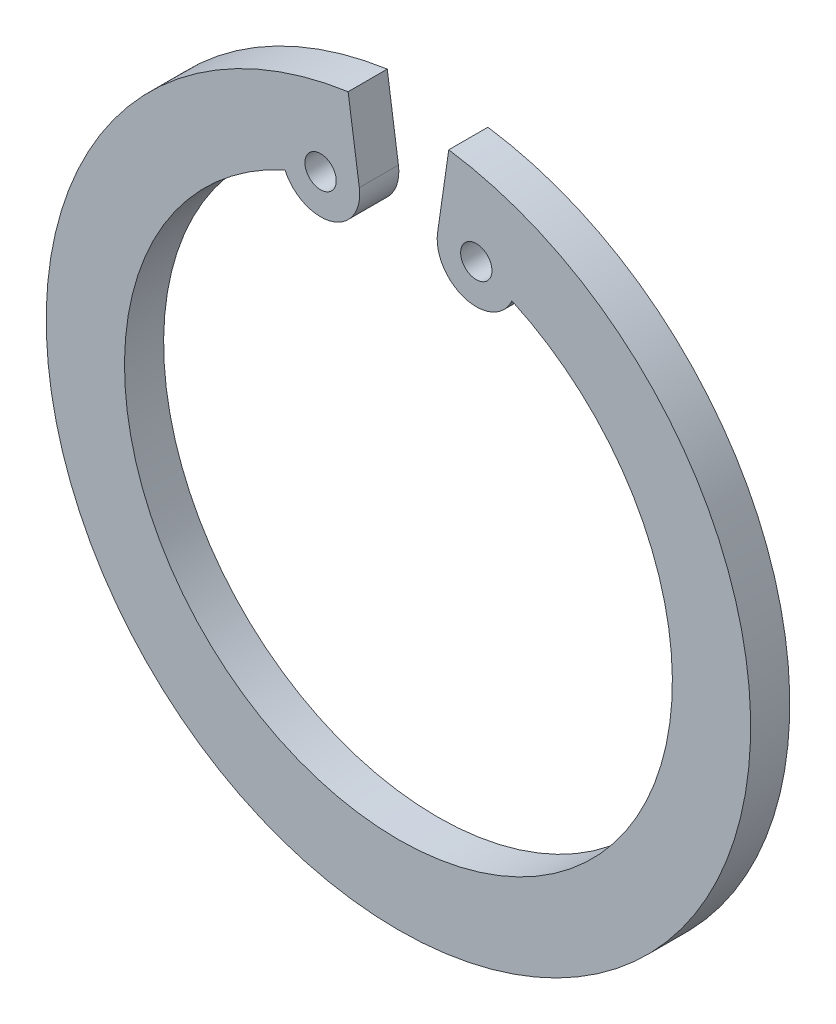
ISO-10303-21;
HEADER;
FILE_DESCRIPTION(('STEP AP214'),'2;1');
FILE_NAME('part.step','',(''),(''),'','','');
FILE_SCHEMA(('AUTOMOTIVE_DESIGN { 1 0 10303 214 1 1 1 1 }'));
ENDSEC;
DATA;
#1=APPLICATION_CONTEXT('core data for automotive mechanical design processes');
#2=APPLICATION_PROTOCOL_DEFINITION('international standard','automotive_design',2000,#1);
#3=PRODUCT_CONTEXT('',#1,'mechanical');
#4=PRODUCT('Part','Part','',(#3));
#5=PRODUCT_RELATED_PRODUCT_CATEGORY('part','',(#4));
#6=PRODUCT_DEFINITION_FORMATION('','',#4);
#7=PRODUCT_DEFINITION_CONTEXT('part definition',#1,'design');
#8=PRODUCT_DEFINITION('design','',#6,#7);
#9=PRODUCT_DEFINITION_SHAPE('','',#8);
#10=(LENGTH_UNIT() NAMED_UNIT(*) SI_UNIT(.MILLI.,.METRE.));
#11=(NAMED_UNIT(*) PLANE_ANGLE_UNIT() SI_UNIT($,.RADIAN.));
#12=(NAMED_UNIT(*) SI_UNIT($,.STERADIAN.) SOLID_ANGLE_UNIT());
#13=UNCERTAINTY_MEASURE_WITH_UNIT(LENGTH_MEASURE(1.E-05),#10,'distance_accuracy_value','');
#14=(GEOMETRIC_REPRESENTATION_CONTEXT(3) GLOBAL_UNCERTAINTY_ASSIGNED_CONTEXT((#13)) GLOBAL_UNIT_ASSIGNED_CONTEXT((#10,
#11,#12)) REPRESENTATION_CONTEXT('',''));
#15=CARTESIAN_POINT('',(0.,0.,0.));
#16=DIRECTION('',(0.,0.,1.));
#17=DIRECTION('',(1.,0.,0.));
#18=AXIS2_PLACEMENT_3D('',#15,#16,#17);
#19=CARTESIAN_POINT('',(0.,-0.211976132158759,-0.396875));
#20=DIRECTION('',(0.,0.,1.));
#21=DIRECTION('',(1.,0.,0.));
#22=AXIS2_PLACEMENT_3D('',#19,#20,#21);
#23=PLANE('',#22);
#24=CARTESIAN_POINT('',(1.57935875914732,5.17389232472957,-0.396875));
#25=DIRECTION('',(0.,0.,1.));
#26=DIRECTION('',(1.,0.,0.));
#27=AXIS2_PLACEMENT_3D('',#24,#25,#26);
#28=CIRCLE('',#27,0.79375);
#29=CARTESIAN_POINT('',(0.793750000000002,5.28728518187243,-0.396875));
#30=VERTEX_POINT('',#29);
#31=CARTESIAN_POINT('',(2.30179316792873,4.84506472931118,-0.396875));
#32=VERTEX_POINT('',#31);
#33=EDGE_CURVE('E110',#30,#32,#28,.T.);
#34=ORIENTED_EDGE('',*,*,#33,.F.);
#35=DIRECTION('',(0.142857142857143,0.989743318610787,0.));
#36=VECTOR('',#35,1.);
#37=CARTESIAN_POINT('',(0.79375,5.28728518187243,-0.396875));
#38=LINE('',#37,#36);
#39=CARTESIAN_POINT('',(1.02053571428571,6.85850270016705,-0.396875));
#40=VERTEX_POINT('',#39);
#41=EDGE_CURVE('E114',#30,#40,#38,.T.);
#42=ORIENTED_EDGE('',*,*,#41,.T.);
#43=CARTESIAN_POINT('',(0.,-0.211976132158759,-0.396875));
#44=DIRECTION('',(0.,0.,-1.));
#45=DIRECTION('',(-1.,0.,0.));
#46=AXIS2_PLACEMENT_3D('',#43,#44,#45);
#47=CIRCLE('',#46,7.14375);
#48=CARTESIAN_POINT('',(-1.02053571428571,6.85850270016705,-0.396875));
#49=VERTEX_POINT('',#48);
#50=EDGE_CURVE('E99',#49,#40,#47,.F.);
#51=ORIENTED_EDGE('',*,*,#50,.F.);
#52=DIRECTION('',(0.142857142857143,-0.989743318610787,0.));
#53=VECTOR('',#52,1.);
#54=CARTESIAN_POINT('',(-1.02053571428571,6.85850270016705,-0.396875));
#55=LINE('',#54,#53);
#56=CARTESIAN_POINT('',(-0.79375,5.28728518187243,-0.396875));
#57=VERTEX_POINT('',#56);
#58=EDGE_CURVE('E95',#49,#57,#55,.T.);
#59=ORIENTED_EDGE('',*,*,#58,.T.);
#60=CARTESIAN_POINT('',(-1.57935875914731,5.17389232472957,-0.396875));
#61=DIRECTION('',(0.,0.,1.));
#62=DIRECTION('',(1.,0.,0.));
#63=AXIS2_PLACEMENT_3D('',#60,#61,#62);
#64=CIRCLE('',#63,0.79375);
#65=CARTESIAN_POINT('',(-2.30179316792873,4.84506472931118,-0.396875));
#66=VERTEX_POINT('',#65);
#67=EDGE_CURVE('E83',#66,#57,#64,.T.);
#68=ORIENTED_EDGE('',*,*,#67,.F.);
#69=CARTESIAN_POINT('',(0.,-0.211976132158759,-0.396875));
#70=DIRECTION('',(0.,0.,-1.));
#71=DIRECTION('',(-1.,0.,0.));
#72=AXIS2_PLACEMENT_3D('',#69,#70,#71);
#73=CIRCLE('',#72,5.55625);
#74=EDGE_CURVE('E93',#66,#32,#73,.F.);
#75=ORIENTED_EDGE('',*,*,#74,.T.);
#76=EDGE_LOOP('',(#34,#42,#51,#59,#68,#75));
#77=FACE_BOUND('',#76,.T.);
#78=CARTESIAN_POINT('',(-1.57935875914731,5.17389232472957,-0.396875));
#79=DIRECTION('',(0.,0.,1.));
#80=DIRECTION('',(1.,0.,0.));
#81=AXIS2_PLACEMENT_3D('',#78,#79,#80);
#82=CIRCLE('',#81,0.3175);
#83=CARTESIAN_POINT('',(-1.26185875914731,5.17389232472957,-0.396875));
#84=VERTEX_POINT('',#83);
#85=EDGE_CURVE('E115',#84,#84,#82,.T.);
#86=ORIENTED_EDGE('',*,*,#85,.T.);
#87=EDGE_LOOP('',(#86));
#88=FACE_BOUND('',#87,.T.);
#89=CARTESIAN_POINT('',(1.57935875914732,5.17389232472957,-0.396875));
#90=DIRECTION('',(0.,0.,1.));
#91=DIRECTION('',(1.,0.,0.));
#92=AXIS2_PLACEMENT_3D('',#89,#90,#91);
#93=CIRCLE('',#92,0.3175);
#94=CARTESIAN_POINT('',(1.89685875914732,5.17389232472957,-0.396875));
#95=VERTEX_POINT('',#94);
#96=EDGE_CURVE('E35',#95,#95,#93,.T.);
#97=ORIENTED_EDGE('',*,*,#96,.T.);
#98=EDGE_LOOP('',(#97));
#99=FACE_BOUND('',#98,.T.);
#100=ADVANCED_FACE('F32',(#77,#88,#99),#23,.F.);
#101=CARTESIAN_POINT('',(1.57935875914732,5.17389232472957,-0.396875));
#102=DIRECTION('',(0.,0.,1.));
#103=DIRECTION('',(1.,0.,0.));
#104=AXIS2_PLACEMENT_3D('',#101,#102,#103);
#105=CYLINDRICAL_SURFACE('',#104,0.3175);
#106=CARTESIAN_POINT('',(1.57935875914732,5.17389232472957,0.396875));
#107=DIRECTION('',(0.,0.,1.));
#108=DIRECTION('',(1.,0.,0.));
#109=AXIS2_PLACEMENT_3D('',#106,#107,#108);
#110=CIRCLE('',#109,0.3175);
#111=CARTESIAN_POINT('',(1.89685875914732,5.17389232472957,0.396875));
#112=VERTEX_POINT('',#111);
#113=EDGE_CURVE('E128',#112,#112,#110,.F.);
#114=ORIENTED_EDGE('',*,*,#113,.F.);
#115=EDGE_LOOP('',(#114));
#116=FACE_BOUND('',#115,.T.);
#117=ORIENTED_EDGE('',*,*,#96,.F.);
#118=EDGE_LOOP('',(#117));
#119=FACE_BOUND('',#118,.T.);
#120=ADVANCED_FACE('F141',(#116,#119),#105,.F.);
#121=CARTESIAN_POINT('',(-1.57935875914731,5.17389232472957,-0.396875));
#122=DIRECTION('',(0.,0.,1.));
#123=DIRECTION('',(1.,0.,0.));
#124=AXIS2_PLACEMENT_3D('',#121,#122,#123);
#125=CYLINDRICAL_SURFACE('',#124,0.3175);
#126=CARTESIAN_POINT('',(-1.57935875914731,5.17389232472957,0.396875));
#127=DIRECTION('',(0.,0.,1.));
#128=DIRECTION('',(1.,0.,0.));
#129=AXIS2_PLACEMENT_3D('',#126,#127,#128);
#130=CIRCLE('',#129,0.3175);
#131=CARTESIAN_POINT('',(-1.26185875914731,5.17389232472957,0.396875));
#132=VERTEX_POINT('',#131);
#133=EDGE_CURVE('E125',#132,#132,#130,.F.);
#134=ORIENTED_EDGE('',*,*,#133,.F.);
#135=EDGE_LOOP('',(#134));
#136=FACE_BOUND('',#135,.T.);
#137=ORIENTED_EDGE('',*,*,#85,.F.);
#138=EDGE_LOOP('',(#137));
#139=FACE_BOUND('',#138,.T.);
#140=ADVANCED_FACE('F143',(#136,#139),#125,.F.);
#141=CARTESIAN_POINT('',(0.79375,5.28728518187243,0.396875));
#142=DIRECTION('',(0.989743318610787,-0.142857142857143,0.));
#143=DIRECTION('',(0.142857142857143,0.989743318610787,0.));
#144=AXIS2_PLACEMENT_3D('',#141,#142,#143);
#145=PLANE('',#144);
#146=DIRECTION('',(0.,0.,1.));
#147=VECTOR('',#146,1.);
#148=CARTESIAN_POINT('',(0.793750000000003,5.28728518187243,-0.396875));
#149=LINE('',#148,#147);
#150=CARTESIAN_POINT('',(0.793750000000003,5.28728518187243,0.396875));
#151=VERTEX_POINT('',#150);
#152=EDGE_CURVE('E111',#151,#30,#149,.F.);
#153=ORIENTED_EDGE('',*,*,#152,.F.);
#154=DIRECTION('',(-0.142857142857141,-0.989743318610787,0.));
#155=VECTOR('',#154,1.);
#156=CARTESIAN_POINT('',(1.02053571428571,6.85850270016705,0.396875));
#157=LINE('',#156,#155);
#158=CARTESIAN_POINT('',(1.02053571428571,6.85850270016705,0.396875));
#159=VERTEX_POINT('',#158);
#160=EDGE_CURVE('E124',#159,#151,#157,.T.);
#161=ORIENTED_EDGE('',*,*,#160,.F.);
#162=DIRECTION('',(0.,0.,-1.));
#163=VECTOR('',#162,1.);
#164=CARTESIAN_POINT('',(1.02053571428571,6.85850270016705,0.396875));
#165=LINE('',#164,#163);
#166=EDGE_CURVE('E131',#40,#159,#165,.F.);
#167=ORIENTED_EDGE('',*,*,#166,.F.);
#168=ORIENTED_EDGE('',*,*,#41,.F.);
#169=EDGE_LOOP('',(#153,#161,#167,#168));
#170=FACE_BOUND('',#169,.T.);
#171=ADVANCED_FACE('F149',(#170),#145,.F.);
#172=CARTESIAN_POINT('',(1.57935875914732,5.17389232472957,-0.396875));
#173=DIRECTION('',(0.,0.,1.));
#174=DIRECTION('',(1.,0.,0.));
#175=AXIS2_PLACEMENT_3D('',#172,#173,#174);
#176=CYLINDRICAL_SURFACE('',#175,0.79375);
#177=ORIENTED_EDGE('',*,*,#152,.T.);
#178=ORIENTED_EDGE('',*,*,#33,.T.);
#179=DIRECTION('',(0.,0.,-1.));
#180=VECTOR('',#179,1.);
#181=CARTESIAN_POINT('',(2.30179316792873,4.84506472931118,0.396875));
#182=LINE('',#181,#180);
#183=CARTESIAN_POINT('',(2.30179316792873,4.84506472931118,0.396875));
#184=VERTEX_POINT('',#183);
#185=EDGE_CURVE('E108',#32,#184,#182,.F.);
#186=ORIENTED_EDGE('',*,*,#185,.T.);
#187=CARTESIAN_POINT('',(1.57935875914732,5.17389232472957,0.396875));
#188=DIRECTION('',(0.,0.,1.));
#189=DIRECTION('',(1.,0.,0.));
#190=AXIS2_PLACEMENT_3D('',#187,#188,#189);
#191=CIRCLE('',#190,0.79375);
#192=EDGE_CURVE('E121',#151,#184,#191,.T.);
#193=ORIENTED_EDGE('',*,*,#192,.F.);
#194=EDGE_LOOP('',(#177,#178,#186,#193));
#195=FACE_BOUND('',#194,.T.);
#196=ADVANCED_FACE('F172',(#195),#176,.T.);
#197=CARTESIAN_POINT('',(0.,-0.211976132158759,0.396875));
#198=DIRECTION('',(0.,0.,-1.));
#199=DIRECTION('',(-1.,0.,0.));
#200=AXIS2_PLACEMENT_3D('',#197,#198,#199);
#201=CYLINDRICAL_SURFACE('',#200,5.55625);
#202=DIRECTION('',(0.,0.,1.));
#203=VECTOR('',#202,1.);
#204=CARTESIAN_POINT('',(-2.30179316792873,4.84506472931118,-0.396875));
#205=LINE('',#204,#203);
#206=CARTESIAN_POINT('',(-2.30179316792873,4.84506472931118,0.396875));
#207=VERTEX_POINT('',#206);
#208=EDGE_CURVE('E90',#207,#66,#205,.F.);
#209=ORIENTED_EDGE('',*,*,#208,.F.);
#210=CARTESIAN_POINT('',(0.,-0.211976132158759,0.396875));
#211=DIRECTION('',(0.,0.,-1.));
#212=DIRECTION('',(-1.,0.,0.));
#213=AXIS2_PLACEMENT_3D('',#210,#211,#212);
#214=CIRCLE('',#213,5.55625);
#215=EDGE_CURVE('E119',#184,#207,#214,.T.);
#216=ORIENTED_EDGE('',*,*,#215,.F.);
#217=ORIENTED_EDGE('',*,*,#185,.F.);
#218=ORIENTED_EDGE('',*,*,#74,.F.);
#219=EDGE_LOOP('',(#209,#216,#217,#218));
#220=FACE_BOUND('',#219,.T.);
#221=ADVANCED_FACE('F169',(#220),#201,.F.);
#222=CARTESIAN_POINT('',(-1.57935875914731,5.17389232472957,-0.396875));
#223=DIRECTION('',(0.,0.,1.));
#224=DIRECTION('',(1.,0.,0.));
#225=AXIS2_PLACEMENT_3D('',#222,#223,#224);
#226=CYLINDRICAL_SURFACE('',#225,0.79375);
#227=CARTESIAN_POINT('',(-1.57935875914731,5.17389232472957,0.396875));
#228=DIRECTION('',(0.,0.,1.));
#229=DIRECTION('',(1.,0.,0.));
#230=AXIS2_PLACEMENT_3D('',#227,#228,#229);
#231=CIRCLE('',#230,0.79375);
#232=CARTESIAN_POINT('',(-0.79375,5.28728518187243,0.396875));
#233=VERTEX_POINT('',#232);
#234=EDGE_CURVE('E117',#207,#233,#231,.T.);
#235=ORIENTED_EDGE('',*,*,#234,.F.);
#236=ORIENTED_EDGE('',*,*,#208,.T.);
#237=ORIENTED_EDGE('',*,*,#67,.T.);
#238=DIRECTION('',(0.,0.,1.));
#239=VECTOR('',#238,1.);
#240=CARTESIAN_POINT('',(-0.79375,5.28728518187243,0.396875));
#241=LINE('',#240,#239);
#242=EDGE_CURVE('E88',#57,#233,#241,.T.);
#243=ORIENTED_EDGE('',*,*,#242,.T.);
#244=EDGE_LOOP('',(#235,#236,#237,#243));
#245=FACE_BOUND('',#244,.T.);
#246=ADVANCED_FACE('F86',(#245),#226,.T.);
#247=CARTESIAN_POINT('',(-1.02053571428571,6.85850270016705,0.396875));
#248=DIRECTION('',(-0.989743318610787,-0.142857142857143,0.));
#249=DIRECTION('',(0.142857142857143,-0.989743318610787,0.));
#250=AXIS2_PLACEMENT_3D('',#247,#248,#249);
#251=PLANE('',#250);
#252=DIRECTION('',(0.,0.,-1.));
#253=VECTOR('',#252,1.);
#254=CARTESIAN_POINT('',(-1.02053571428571,6.85850270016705,0.396875));
#255=LINE('',#254,#253);
#256=CARTESIAN_POINT('',(-1.02053571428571,6.85850270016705,0.396875));
#257=VERTEX_POINT('',#256);
#258=EDGE_CURVE('E49',#257,#49,#255,.T.);
#259=ORIENTED_EDGE('',*,*,#258,.F.);
#260=DIRECTION('',(-0.142857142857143,0.989743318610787,0.));
#261=VECTOR('',#260,1.);
#262=CARTESIAN_POINT('',(-0.79375,5.28728518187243,0.396875));
#263=LINE('',#262,#261);
#264=EDGE_CURVE('E41',#233,#257,#263,.T.);
#265=ORIENTED_EDGE('',*,*,#264,.F.);
#266=ORIENTED_EDGE('',*,*,#242,.F.);
#267=ORIENTED_EDGE('',*,*,#58,.F.);
#268=EDGE_LOOP('',(#259,#265,#266,#267));
#269=FACE_BOUND('',#268,.T.);
#270=ADVANCED_FACE('F101',(#269),#251,.F.);
#271=CARTESIAN_POINT('',(0.,-0.211976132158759,0.396875));
#272=DIRECTION('',(0.,0.,-1.));
#273=DIRECTION('',(-1.,0.,0.));
#274=AXIS2_PLACEMENT_3D('',#271,#272,#273);
#275=CYLINDRICAL_SURFACE('',#274,7.14375);
#276=ORIENTED_EDGE('',*,*,#50,.T.);
#277=ORIENTED_EDGE('',*,*,#166,.T.);
#278=CARTESIAN_POINT('',(0.,-0.211976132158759,0.396875));
#279=DIRECTION('',(0.,0.,-1.));
#280=DIRECTION('',(-1.,0.,0.));
#281=AXIS2_PLACEMENT_3D('',#278,#279,#280);
#282=CIRCLE('',#281,7.14375);
#283=EDGE_CURVE('E11',#257,#159,#282,.F.);
#284=ORIENTED_EDGE('',*,*,#283,.F.);
#285=ORIENTED_EDGE('',*,*,#258,.T.);
#286=EDGE_LOOP('',(#276,#277,#284,#285));
#287=FACE_BOUND('',#286,.T.);
#288=ADVANCED_FACE('F155',(#287),#275,.T.);
#289=CARTESIAN_POINT('',(0.,-0.211976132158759,0.396875));
#290=DIRECTION('',(0.,0.,1.));
#291=DIRECTION('',(1.,0.,0.));
#292=AXIS2_PLACEMENT_3D('',#289,#290,#291);
#293=PLANE('',#292);
#294=ORIENTED_EDGE('',*,*,#283,.T.);
#295=ORIENTED_EDGE('',*,*,#160,.T.);
#296=ORIENTED_EDGE('',*,*,#192,.T.);
#297=ORIENTED_EDGE('',*,*,#215,.T.);
#298=ORIENTED_EDGE('',*,*,#234,.T.);
#299=ORIENTED_EDGE('',*,*,#264,.T.);
#300=EDGE_LOOP('',(#294,#295,#296,#297,#298,#299));
#301=FACE_BOUND('',#300,.T.);
#302=ORIENTED_EDGE('',*,*,#133,.T.);
#303=EDGE_LOOP('',(#302));
#304=FACE_BOUND('',#303,.T.);
#305=ORIENTED_EDGE('',*,*,#113,.T.);
#306=EDGE_LOOP('',(#305));
#307=FACE_BOUND('',#306,.T.);
#308=ADVANCED_FACE('F153',(#301,#304,#307),#293,.T.);
#309=CLOSED_SHELL('',(#100,#120,#140,#171,#196,#221,#246,#270,#288,#308));
#310=MANIFOLD_SOLID_BREP('B2',#309);
#311=ADVANCED_BREP_SHAPE_REPRESENTATION('',(#18,#310),#14);
#312=SHAPE_DEFINITION_REPRESENTATION(#9,#311);
ENDSEC;
END-ISO-10303-21;
